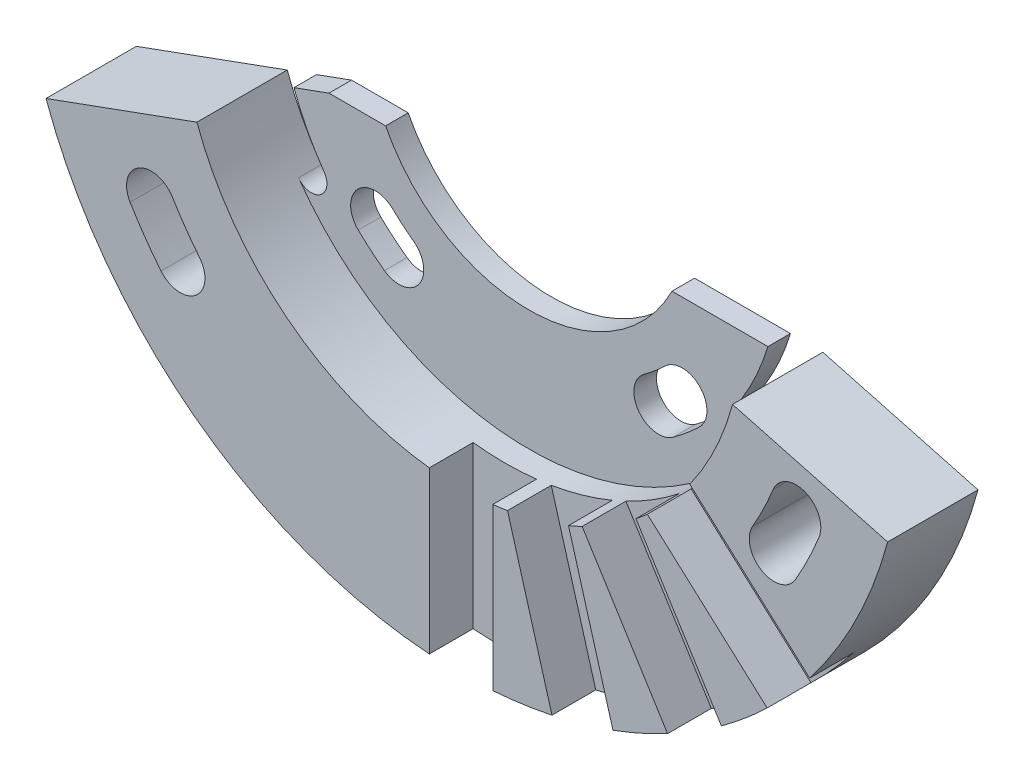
from build123d import *

# Parameters (mm, degrees)
BOSS_EXTRUDE1_DEPTH = 7.14375
BOSS_EXTRUDE2_DEPTH = 7.14375
SKETCH2_W           = 5.0165
SKETCH2_H           = 6.35
CUT_EXTRUDE1_DEPTH  = 31.75
CIRPATTERN1_COUNT   = 4
CIRPATTERN1_ANGLE   = 48
CUT_EXTRUDE3_DEPTH  = 5.3594
CUT_EXTRUDE5_DEPTH  = 45.534270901
CUT_EXTRUDE2_DEPTH  = 45.78405163
SKETCH8_R           = 3.175
CUT_EXTRUDE4_DEPTH  = 45.78405163
CUT_EXTRUDE6_DEPTH  = 45.011515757


with BuildPart() as part:
    # Sketch1 → Boss-Extrude1 (new body)
    with BuildSketch(Plane.XY):
        with BuildLine():
            Line((-20.884668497, 20.973602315), (-32.818764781, 16.629946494))
            ThreePointArc((-32.818764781, 16.629946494), (1.523407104, -6.316759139), (33.734959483, 19.53574485))
            Line((33.734959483, 19.53574485), (21.467701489, 22.822746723))
            ThreePointArc((21.467701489, 22.822746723), (0.969440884, 6.371153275), (-20.884668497, 20.973602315))
        make_face()
    extrude(amount=BOSS_EXTRUDE1_DEPTH)

    # Sketch6 → Boss-Extrude2 (add)
    with BuildSketch(Plane.XY):
        with BuildLine():
            Line((0, 28.575), (-20.884668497, 20.973602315))
            ThreePointArc((-20.884668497, 20.973602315), (0.969440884, 6.371153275), (21.467701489, 22.822746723))
            Line((21.467701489, 22.822746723), (0, 28.575))
        make_face()
    extrude(amount=BOSS_EXTRUDE2_DEPTH)

    # Sketch2 → Cut-Extrude1 (cut, symmetric)
    with BuildSketch(Plane(origin=(0, 0, 0), x_dir=(1, 0, 0), z_dir=(0, 1, 0))):
        with Locations((0, -6.858)):
            Rectangle(SKETCH2_W, SKETCH2_H)
    cut_extrude1 = extrude(amount=CUT_EXTRUDE1_DEPTH, both=True, mode=Mode.SUBTRACT)

    # CirPattern1: Cut-Extrude1 ×4 about axis
    cirpattern1_axis = Axis((0, 28.575, 0), (0, 0, 1))
    for i in range(1, CIRPATTERN1_COUNT):
        add(cut_extrude1.rotate(cirpattern1_axis, i * CIRPATTERN1_ANGLE / (CIRPATTERN1_COUNT - 1)), mode=Mode.SUBTRACT)

    # Sketch7 → Cut-Extrude3 (cut)
    with BuildSketch(Plane.XY.offset(7.14375)):
        with BuildLine():
            Line((0, 28.575), (-20.884668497, 20.973602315))
            ThreePointArc((-20.884668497, 20.973602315), (0.969440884, 6.371153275), (21.467701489, 22.822746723))
            Line((21.467701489, 22.822746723), (0, 28.575))
        make_face()
    extrude(amount=-CUT_EXTRUDE3_DEPTH, mode=Mode.SUBTRACT)

    # Sketch11 → Cut-Extrude5 (cut, through all)
    with BuildSketch(Plane.XY.offset(1.78435)):
        with BuildLine():
            ThreePointArc((-21.014150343, 21.339247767), (-19.80262, 18.485061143), (-18.205654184, 15.827263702))
            ThreePointArc((-18.205654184, 15.827263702), (-16.489951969, 15.524739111), (-16.187427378, 17.240441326))
            ThreePointArc((-16.187427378, 17.240441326), (-17.607358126, 19.603602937), (-18.684581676, 22.141382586))
            ThreePointArc((-18.684581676, 22.141382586), (-20.250433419, 22.90509951), (-21.014150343, 21.339247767))
        make_face()
        with BuildLine():
            ThreePointArc((18.205654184, 15.827263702), (20.53322261, 20.069860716), (21.887352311, 24.715669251))
            ThreePointArc((21.887352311, 24.715669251), (20.88808483, 26.142771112), (19.460982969, 25.143503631))
            ThreePointArc((19.460982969, 25.143503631), (18.256968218, 21.012716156), (16.187427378, 17.240441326))
            ThreePointArc((16.187427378, 17.240441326), (16.489951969, 15.524739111), (18.205654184, 15.827263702))
        make_face()
    extrude(amount=-CUT_EXTRUDE5_DEPTH, mode=Mode.SUBTRACT)

    # Sketch4 → Cut-Extrude2 (cut, through all)
    with BuildSketch(Plane.XY.offset(7.14375)):
        with BuildLine():
            ThreePointArc((-26.170003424, 12.850475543), (-25.009367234, 11.063252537), (-23.72688792, 9.361345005))
            ThreePointArc((-23.72688792, 9.361345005), (-20.976121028, 9.072227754), (-20.687003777, 11.822994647))
            ThreePointArc((-20.687003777, 11.822994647), (-21.805172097, 13.306854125), (-22.817107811, 14.865098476))
            ThreePointArc((-22.817107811, 14.865098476), (-25.500867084, 15.534234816), (-26.170003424, 12.850475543))
        make_face()
        with BuildLine():
            ThreePointArc((28.307664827, 17.137961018), (27.440901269, 15.191178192), (26.440448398, 13.3096))
            ThreePointArc((26.440448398, 13.3096), (23.768775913, 12.593727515), (23.052903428, 15.2654))
            ThreePointArc((23.052903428, 15.2654), (23.925178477, 16.905910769), (24.680892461, 18.603272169))
            ThreePointArc((24.680892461, 18.603272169), (27.22693422, 19.684002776), (28.307664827, 17.137961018))
        make_face()
    extrude(amount=-CUT_EXTRUDE2_DEPTH, mode=Mode.SUBTRACT)

    # Sketch8 → Cut-Extrude4 (cut, through all)
    with BuildSketch(Plane.XY.offset(7.14375)):
        with Locations((0, 28.575)):
            Circle(SKETCH8_R)
        with BuildLine():
            ThreePointArc((11.413790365, 12.865265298), (12.481842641, 13.69971919), (13.489084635, 14.606643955))
            ThreePointArc((13.489084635, 14.606643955), (13.537356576, 17.372141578), (10.771858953, 17.420413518))
            ThreePointArc((10.771858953, 17.420413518), (9.967514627, 16.696178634), (9.114609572, 16.029816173))
            ThreePointArc((9.114609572, 16.029816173), (8.681924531, 13.297950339), (11.413790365, 12.865265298))
        make_face()
        with BuildLine():
            ThreePointArc((-13.489084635, 14.606643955), (-12.481842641, 13.69971919), (-11.413790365, 12.865265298))
            ThreePointArc((-11.413790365, 12.865265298), (-8.681924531, 13.297950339), (-9.114609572, 16.029816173))
            ThreePointArc((-9.114609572, 16.029816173), (-9.967514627, 16.696178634), (-10.771858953, 17.420413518))
            ThreePointArc((-10.771858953, 17.420413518), (-13.537356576, 17.372141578), (-13.489084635, 14.606643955))
        make_face()
    extrude(amount=-CUT_EXTRUDE4_DEPTH, mode=Mode.SUBTRACT)

    # Sketch12 → Cut-Extrude6 (cut, through all)
    with BuildSketch(Plane.XY.offset(1.78435)):
        with BuildLine():
            Line((-21.68760145, 22.822746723), (-11.322613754, 22.822746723))
            ThreePointArc((-11.322613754, 22.822746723), (0, 15.875), (11.322613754, 22.822746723))
            Line((11.322613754, 22.822746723), (21.467701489, 22.822746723))
            Line((21.467701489, 22.822746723), (21.467701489, 28.575))
            Line((21.467701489, 28.575), (-21.68760145, 28.575))
            Line((-21.68760145, 28.575), (-21.68760145, 22.822746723))
        make_face()
    extrude(amount=-CUT_EXTRUDE6_DEPTH, mode=Mode.SUBTRACT)


solid = part.part
